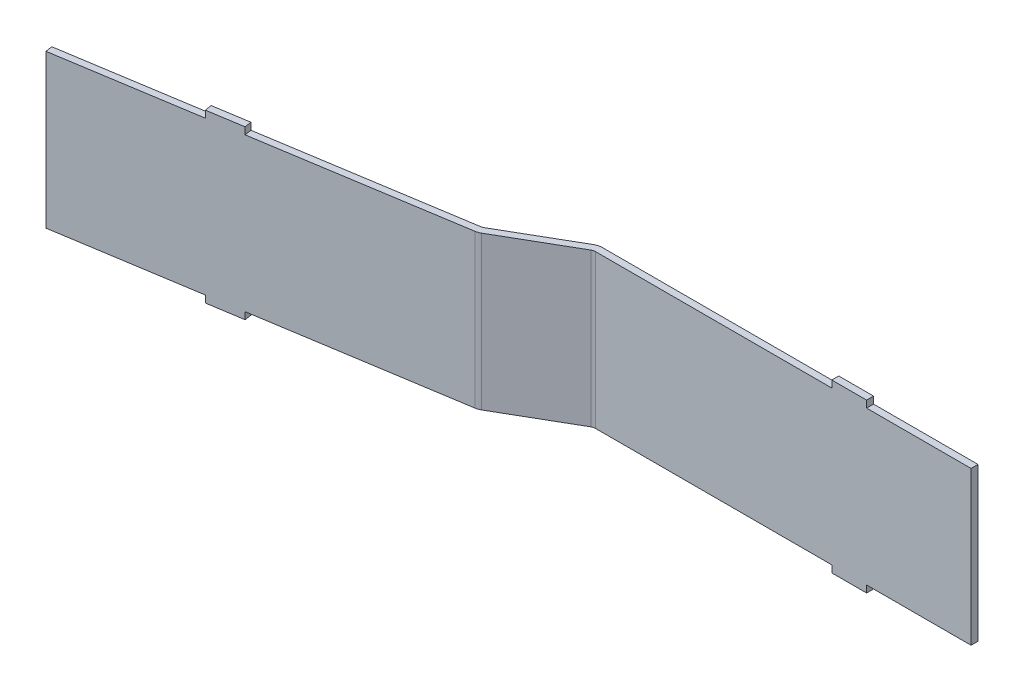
ISO-10303-21;
HEADER;
FILE_DESCRIPTION(('STEP AP214'),'2;1');
FILE_NAME('part.step','',(''),(''),'','','');
FILE_SCHEMA(('AUTOMOTIVE_DESIGN { 1 0 10303 214 1 1 1 1 }'));
ENDSEC;
DATA;
#1=APPLICATION_CONTEXT('core data for automotive mechanical design processes');
#2=APPLICATION_PROTOCOL_DEFINITION('international standard','automotive_design',2000,#1);
#3=PRODUCT_CONTEXT('',#1,'mechanical');
#4=PRODUCT('Part','Part','',(#3));
#5=PRODUCT_RELATED_PRODUCT_CATEGORY('part','',(#4));
#6=PRODUCT_DEFINITION_FORMATION('','',#4);
#7=PRODUCT_DEFINITION_CONTEXT('part definition',#1,'design');
#8=PRODUCT_DEFINITION('design','',#6,#7);
#9=PRODUCT_DEFINITION_SHAPE('','',#8);
#10=(LENGTH_UNIT() NAMED_UNIT(*) SI_UNIT(.MILLI.,.METRE.));
#11=(NAMED_UNIT(*) PLANE_ANGLE_UNIT() SI_UNIT($,.RADIAN.));
#12=(NAMED_UNIT(*) SI_UNIT($,.STERADIAN.) SOLID_ANGLE_UNIT());
#13=UNCERTAINTY_MEASURE_WITH_UNIT(LENGTH_MEASURE(1.E-05),#10,'distance_accuracy_value','');
#14=(GEOMETRIC_REPRESENTATION_CONTEXT(3) GLOBAL_UNCERTAINTY_ASSIGNED_CONTEXT((#13)) GLOBAL_UNIT_ASSIGNED_CONTEXT((#10,
#11,#12)) REPRESENTATION_CONTEXT('',''));
#15=CARTESIAN_POINT('',(0.,0.,0.));
#16=DIRECTION('',(0.,0.,1.));
#17=DIRECTION('',(1.,0.,0.));
#18=AXIS2_PLACEMENT_3D('',#15,#16,#17);
#19=CARTESIAN_POINT('',(-20.79029894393,44.,12.15667412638));
#20=DIRECTION('',(0.156434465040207,0.,0.987688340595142));
#21=DIRECTION('',(0.987688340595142,0.,-0.156434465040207));
#22=AXIS2_PLACEMENT_3D('',#19,#20,#21);
#23=PLANE('',#22);
#24=DIRECTION('',(-0.987688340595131,0.,0.156434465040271));
#25=VECTOR('',#24,1.);
#26=CARTESIAN_POINT('',(-88.4469502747,44.,22.87243498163));
#27=LINE('',#26,#25);
#28=CARTESIAN_POINT('',(-88.4469502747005,44.,22.8724349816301));
#29=VERTEX_POINT('',#28);
#30=CARTESIAN_POINT('',(-127.954483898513,44.,29.1298135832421));
#31=VERTEX_POINT('',#30);
#32=EDGE_CURVE('E258',#29,#31,#27,.T.);
#33=ORIENTED_EDGE('',*,*,#32,.F.);
#34=DIRECTION('',(0.,1.,0.));
#35=VECTOR('',#34,1.);
#36=CARTESIAN_POINT('',(-88.4469502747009,45.,22.8724349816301));
#37=LINE('',#36,#35);
#38=CARTESIAN_POINT('',(-88.4469502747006,46.,22.8724349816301));
#39=VERTEX_POINT('',#38);
#40=EDGE_CURVE('E262',#39,#29,#37,.F.);
#41=ORIENTED_EDGE('',*,*,#40,.F.);
#42=DIRECTION('',(-0.98768834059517,0.,0.156434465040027));
#43=VECTOR('',#42,1.);
#44=CARTESIAN_POINT('',(-78.57006686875,46.,21.30809033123));
#45=LINE('',#44,#43);
#46=CARTESIAN_POINT('',(-78.5700668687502,46.,21.3080903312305));
#47=VERTEX_POINT('',#46);
#48=EDGE_CURVE('E276',#47,#39,#45,.T.);
#49=ORIENTED_EDGE('',*,*,#48,.F.);
#50=DIRECTION('',(0.,1.,0.));
#51=VECTOR('',#50,1.);
#52=CARTESIAN_POINT('',(-78.5700668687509,45.,21.3080903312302));
#53=LINE('',#52,#51);
#54=CARTESIAN_POINT('',(-78.5700668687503,44.,21.3080903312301));
#55=VERTEX_POINT('',#54);
#56=EDGE_CURVE('E243',#55,#47,#53,.T.);
#57=ORIENTED_EDGE('',*,*,#56,.F.);
#58=DIRECTION('',(-0.987688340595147,0.,0.156434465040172));
#59=VECTOR('',#58,1.);
#60=CARTESIAN_POINT('',(-21.52252779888,44.,12.27264778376));
#61=LINE('',#60,#59);
#62=CARTESIAN_POINT('',(-21.5225277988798,44.,12.2726477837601));
#63=VERTEX_POINT('',#62);
#64=EDGE_CURVE('E205',#63,#55,#61,.T.);
#65=ORIENTED_EDGE('',*,*,#64,.F.);
#66=DIRECTION('',(0.,1.,0.));
#67=VECTOR('',#66,1.);
#68=CARTESIAN_POINT('',(-21.5225277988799,0.,12.2726477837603));
#69=LINE('',#68,#67);
#70=CARTESIAN_POINT('',(-21.5225277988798,0.,12.2726477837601));
#71=VERTEX_POINT('',#70);
#72=EDGE_CURVE('E199',#63,#71,#69,.F.);
#73=ORIENTED_EDGE('',*,*,#72,.T.);
#74=DIRECTION('',(0.987688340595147,0.,-0.156434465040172));
#75=VECTOR('',#74,1.);
#76=CARTESIAN_POINT('',(-78.57006686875,0.,21.30809033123));
#77=LINE('',#76,#75);
#78=CARTESIAN_POINT('',(-78.5700668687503,0.,21.3080903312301));
#79=VERTEX_POINT('',#78);
#80=EDGE_CURVE('E202',#79,#71,#77,.T.);
#81=ORIENTED_EDGE('',*,*,#80,.F.);
#82=DIRECTION('',(0.,1.,0.));
#83=VECTOR('',#82,1.);
#84=CARTESIAN_POINT('',(-78.5700668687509,-1.,21.3080903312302));
#85=LINE('',#84,#83);
#86=CARTESIAN_POINT('',(-78.5700668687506,-2.,21.3080903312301));
#87=VERTEX_POINT('',#86);
#88=EDGE_CURVE('E246',#87,#79,#85,.T.);
#89=ORIENTED_EDGE('',*,*,#88,.F.);
#90=DIRECTION('',(0.98768834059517,0.,-0.156434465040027));
#91=VECTOR('',#90,1.);
#92=CARTESIAN_POINT('',(-88.4469502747,-2.,22.87243498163));
#93=LINE('',#92,#91);
#94=CARTESIAN_POINT('',(-88.4469502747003,-2.,22.8724349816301));
#95=VERTEX_POINT('',#94);
#96=EDGE_CURVE('E293',#95,#87,#93,.T.);
#97=ORIENTED_EDGE('',*,*,#96,.F.);
#98=DIRECTION('',(0.,1.,0.));
#99=VECTOR('',#98,1.);
#100=CARTESIAN_POINT('',(-88.4469502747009,-1.,22.8724349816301));
#101=LINE('',#100,#99);
#102=CARTESIAN_POINT('',(-88.4469502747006,0.,22.8724349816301));
#103=VERTEX_POINT('',#102);
#104=EDGE_CURVE('E298',#103,#95,#101,.F.);
#105=ORIENTED_EDGE('',*,*,#104,.F.);
#106=DIRECTION('',(0.987688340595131,0.,-0.156434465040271));
#107=VECTOR('',#106,1.);
#108=CARTESIAN_POINT('',(-127.9544838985,0.,29.12981358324));
#109=LINE('',#108,#107);
#110=CARTESIAN_POINT('',(-127.954483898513,0.,29.1298135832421));
#111=VERTEX_POINT('',#110);
#112=EDGE_CURVE('E303',#111,#103,#109,.T.);
#113=ORIENTED_EDGE('',*,*,#112,.F.);
#114=DIRECTION('',(0.,1.,0.));
#115=VECTOR('',#114,1.);
#116=CARTESIAN_POINT('',(-127.95448389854,22.,29.1298135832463));
#117=LINE('',#116,#115);
#118=EDGE_CURVE('E253',#31,#111,#117,.F.);
#119=ORIENTED_EDGE('',*,*,#118,.F.);
#120=EDGE_LOOP('',(#33,#41,#49,#57,#65,#73,#81,#89,#97,#105,#113,#119));
#121=FACE_BOUND('',#120,.T.);
#122=ADVANCED_FACE('F17',(#121),#23,.F.);
#123=CARTESIAN_POINT('',(-127.7980494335,22.,30.11750192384));
#124=DIRECTION('',(-0.987688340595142,0.,0.156434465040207));
#125=DIRECTION('',(0.156434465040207,0.,0.987688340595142));
#126=AXIS2_PLACEMENT_3D('',#123,#124,#125);
#127=PLANE('',#126);
#128=DIRECTION('',(-0.156434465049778,0.,-0.987688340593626));
#129=VECTOR('',#128,1.);
#130=CARTESIAN_POINT('',(-127.6416149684,0.,31.10519026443));
#131=LINE('',#130,#129);
#132=CARTESIAN_POINT('',(-127.6416149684,0.,31.1051902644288));
#133=VERTEX_POINT('',#132);
#134=EDGE_CURVE('E255',#133,#111,#131,.T.);
#135=ORIENTED_EDGE('',*,*,#134,.F.);
#136=DIRECTION('',(0.,1.,0.));
#137=VECTOR('',#136,1.);
#138=CARTESIAN_POINT('',(-127.6416149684,44.,31.1051902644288));
#139=LINE('',#138,#137);
#140=CARTESIAN_POINT('',(-127.6416149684,44.,31.1051902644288));
#141=VERTEX_POINT('',#140);
#142=EDGE_CURVE('E209',#141,#133,#139,.F.);
#143=ORIENTED_EDGE('',*,*,#142,.F.);
#144=DIRECTION('',(0.156434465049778,0.,0.987688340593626));
#145=VECTOR('',#144,1.);
#146=CARTESIAN_POINT('',(-127.9544838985,44.,29.12981358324));
#147=LINE('',#146,#145);
#148=EDGE_CURVE('E261',#31,#141,#147,.T.);
#149=ORIENTED_EDGE('',*,*,#148,.F.);
#150=ORIENTED_EDGE('',*,*,#118,.T.);
#151=EDGE_LOOP('',(#135,#143,#149,#150));
#152=FACE_BOUND('',#151,.T.);
#153=ADVANCED_FACE('F409',(#152),#127,.T.);
#154=CARTESIAN_POINT('',(-74.58207138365,0.,21.6889190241));
#155=DIRECTION('',(0.,-1.,0.));
#156=DIRECTION('',(0.,0.,-1.));
#157=AXIS2_PLACEMENT_3D('',#154,#155,#156);
#158=PLANE('',#157);
#159=ORIENTED_EDGE('',*,*,#112,.T.);
#160=DIRECTION('',(0.156434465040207,0.,0.987688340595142));
#161=VECTOR('',#160,1.);
#162=CARTESIAN_POINT('',(-88.29051580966,0.,23.86012332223));
#163=LINE('',#162,#161);
#164=CARTESIAN_POINT('',(-88.1340813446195,0.,24.8478116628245));
#165=VERTEX_POINT('',#164);
#166=EDGE_CURVE('E300',#165,#103,#163,.F.);
#167=ORIENTED_EDGE('',*,*,#166,.F.);
#168=DIRECTION('',(0.987688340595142,0.,-0.156434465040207));
#169=VECTOR('',#168,1.);
#170=CARTESIAN_POINT('',(-20.47743001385,0.,14.13205080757));
#171=LINE('',#170,#169);
#172=EDGE_CURVE('E387',#133,#165,#171,.T.);
#173=ORIENTED_EDGE('',*,*,#172,.F.);
#174=ORIENTED_EDGE('',*,*,#134,.T.);
#175=EDGE_LOOP('',(#159,#167,#173,#174));
#176=FACE_BOUND('',#175,.T.);
#177=ADVANCED_FACE('F415',(#176),#158,.T.);
#178=CARTESIAN_POINT('',(-88.29051580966,-1.,23.86012332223));
#179=DIRECTION('',(-0.987688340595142,0.,0.156434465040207));
#180=DIRECTION('',(0.156434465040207,0.,0.987688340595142));
#181=AXIS2_PLACEMENT_3D('',#178,#179,#180);
#182=PLANE('',#181);
#183=ORIENTED_EDGE('',*,*,#166,.T.);
#184=ORIENTED_EDGE('',*,*,#104,.T.);
#185=DIRECTION('',(-0.15643446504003,0.,-0.98768834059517));
#186=VECTOR('',#185,1.);
#187=CARTESIAN_POINT('',(-88.13408134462,-2.,24.84781166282));
#188=LINE('',#187,#186);
#189=CARTESIAN_POINT('',(-88.1340813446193,-2.,24.8478116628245));
#190=VERTEX_POINT('',#189);
#191=EDGE_CURVE('E295',#190,#95,#188,.T.);
#192=ORIENTED_EDGE('',*,*,#191,.F.);
#193=DIRECTION('',(0.,1.,0.));
#194=VECTOR('',#193,1.);
#195=CARTESIAN_POINT('',(-88.1340813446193,44.,24.8478116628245));
#196=LINE('',#195,#194);
#197=EDGE_CURVE('E378',#165,#190,#196,.F.);
#198=ORIENTED_EDGE('',*,*,#197,.F.);
#199=EDGE_LOOP('',(#183,#184,#192,#198));
#200=FACE_BOUND('',#199,.T.);
#201=ADVANCED_FACE('F418',(#200),#182,.T.);
#202=CARTESIAN_POINT('',(-83.35207410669,-2.,23.07795099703));
#203=DIRECTION('',(0.,-1.,0.));
#204=DIRECTION('',(0.,0.,-1.));
#205=AXIS2_PLACEMENT_3D('',#202,#203,#204);
#206=PLANE('',#205);
#207=ORIENTED_EDGE('',*,*,#191,.T.);
#208=ORIENTED_EDGE('',*,*,#96,.T.);
#209=DIRECTION('',(-0.156434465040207,0.,-0.987688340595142));
#210=VECTOR('',#209,1.);
#211=CARTESIAN_POINT('',(-78.41363240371,-2.,22.29577867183));
#212=LINE('',#211,#210);
#213=CARTESIAN_POINT('',(-78.2571979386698,-2.,23.2834670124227));
#214=VERTEX_POINT('',#213);
#215=EDGE_CURVE('E250',#214,#87,#212,.T.);
#216=ORIENTED_EDGE('',*,*,#215,.F.);
#217=DIRECTION('',(0.987688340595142,0.,-0.156434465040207));
#218=VECTOR('',#217,1.);
#219=CARTESIAN_POINT('',(-20.47743001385,-2.,14.13205080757));
#220=LINE('',#219,#218);
#221=EDGE_CURVE('E369',#190,#214,#220,.T.);
#222=ORIENTED_EDGE('',*,*,#221,.F.);
#223=EDGE_LOOP('',(#207,#208,#216,#222));
#224=FACE_BOUND('',#223,.T.);
#225=ADVANCED_FACE('F422',(#224),#206,.T.);
#226=CARTESIAN_POINT('',(-78.41363240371,-1.,22.29577867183));
#227=DIRECTION('',(0.987688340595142,0.,-0.156434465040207));
#228=DIRECTION('',(-0.156434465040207,0.,-0.987688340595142));
#229=AXIS2_PLACEMENT_3D('',#226,#227,#228);
#230=PLANE('',#229);
#231=ORIENTED_EDGE('',*,*,#215,.T.);
#232=ORIENTED_EDGE('',*,*,#88,.T.);
#233=DIRECTION('',(-0.156434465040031,0.,-0.98768834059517));
#234=VECTOR('',#233,1.);
#235=CARTESIAN_POINT('',(-78.25719793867,0.,23.28346701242));
#236=LINE('',#235,#234);
#237=CARTESIAN_POINT('',(-78.2571979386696,0.,23.2834670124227));
#238=VERTEX_POINT('',#237);
#239=EDGE_CURVE('E219',#238,#79,#236,.T.);
#240=ORIENTED_EDGE('',*,*,#239,.F.);
#241=DIRECTION('',(0.,1.,0.));
#242=VECTOR('',#241,1.);
#243=CARTESIAN_POINT('',(-78.2571979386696,44.,23.2834670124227));
#244=LINE('',#243,#242);
#245=EDGE_CURVE('E349',#214,#238,#244,.T.);
#246=ORIENTED_EDGE('',*,*,#245,.F.);
#247=EDGE_LOOP('',(#231,#232,#240,#246));
#248=FACE_BOUND('',#247,.T.);
#249=ADVANCED_FACE('F426',(#248),#230,.T.);
#250=CARTESIAN_POINT('',(-78.41363240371,45.,22.29577867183));
#251=DIRECTION('',(0.987688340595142,0.,-0.156434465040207));
#252=DIRECTION('',(-0.156434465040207,0.,-0.987688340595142));
#253=AXIS2_PLACEMENT_3D('',#250,#251,#252);
#254=PLANE('',#253);
#255=DIRECTION('',(0.156434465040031,0.,0.98768834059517));
#256=VECTOR('',#255,1.);
#257=CARTESIAN_POINT('',(-78.57006686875,44.,21.30809033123));
#258=LINE('',#257,#256);
#259=CARTESIAN_POINT('',(-78.2571979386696,44.,23.2834670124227));
#260=VERTEX_POINT('',#259);
#261=EDGE_CURVE('E210',#55,#260,#258,.T.);
#262=ORIENTED_EDGE('',*,*,#261,.F.);
#263=ORIENTED_EDGE('',*,*,#56,.T.);
#264=DIRECTION('',(-0.156434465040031,0.,-0.98768834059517));
#265=VECTOR('',#264,1.);
#266=CARTESIAN_POINT('',(-78.25719793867,46.,23.28346701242));
#267=LINE('',#266,#265);
#268=CARTESIAN_POINT('',(-78.2571979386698,46.,23.283467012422));
#269=VERTEX_POINT('',#268);
#270=EDGE_CURVE('E245',#269,#47,#267,.T.);
#271=ORIENTED_EDGE('',*,*,#270,.F.);
#272=DIRECTION('',(0.,1.,0.));
#273=VECTOR('',#272,1.);
#274=CARTESIAN_POINT('',(-78.2571979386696,44.,23.2834670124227));
#275=LINE('',#274,#273);
#276=EDGE_CURVE('E286',#260,#269,#275,.T.);
#277=ORIENTED_EDGE('',*,*,#276,.F.);
#278=EDGE_LOOP('',(#262,#263,#271,#277));
#279=FACE_BOUND('',#278,.T.);
#280=ADVANCED_FACE('F782',(#279),#254,.T.);
#281=CARTESIAN_POINT('',(-83.35207410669,46.,23.07795099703));
#282=DIRECTION('',(0.,1.,0.));
#283=DIRECTION('',(0.,0.,1.));
#284=AXIS2_PLACEMENT_3D('',#281,#282,#283);
#285=PLANE('',#284);
#286=ORIENTED_EDGE('',*,*,#270,.T.);
#287=ORIENTED_EDGE('',*,*,#48,.T.);
#288=DIRECTION('',(0.156434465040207,0.,0.987688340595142));
#289=VECTOR('',#288,1.);
#290=CARTESIAN_POINT('',(-88.29051580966,46.,23.86012332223));
#291=LINE('',#290,#289);
#292=CARTESIAN_POINT('',(-88.1340813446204,46.,24.8478116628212));
#293=VERTEX_POINT('',#292);
#294=EDGE_CURVE('E267',#293,#39,#291,.F.);
#295=ORIENTED_EDGE('',*,*,#294,.F.);
#296=DIRECTION('',(0.987688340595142,0.,-0.156434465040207));
#297=VECTOR('',#296,1.);
#298=CARTESIAN_POINT('',(-20.47743001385,46.,14.13205080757));
#299=LINE('',#298,#297);
#300=EDGE_CURVE('E235',#269,#293,#299,.F.);
#301=ORIENTED_EDGE('',*,*,#300,.F.);
#302=EDGE_LOOP('',(#286,#287,#295,#301));
#303=FACE_BOUND('',#302,.T.);
#304=ADVANCED_FACE('F774',(#303),#285,.T.);
#305=CARTESIAN_POINT('',(-88.29051580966,45.,23.86012332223));
#306=DIRECTION('',(-0.987688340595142,0.,0.156434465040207));
#307=DIRECTION('',(0.156434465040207,0.,0.987688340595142));
#308=AXIS2_PLACEMENT_3D('',#305,#306,#307);
#309=PLANE('',#308);
#310=ORIENTED_EDGE('',*,*,#294,.T.);
#311=ORIENTED_EDGE('',*,*,#40,.T.);
#312=DIRECTION('',(-0.15643446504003,0.,-0.98768834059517));
#313=VECTOR('',#312,1.);
#314=CARTESIAN_POINT('',(-88.13408134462,44.,24.84781166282));
#315=LINE('',#314,#313);
#316=CARTESIAN_POINT('',(-88.1340813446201,44.,24.8478116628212));
#317=VERTEX_POINT('',#316);
#318=EDGE_CURVE('E220',#317,#29,#315,.T.);
#319=ORIENTED_EDGE('',*,*,#318,.F.);
#320=DIRECTION('',(0.,1.,0.));
#321=VECTOR('',#320,1.);
#322=CARTESIAN_POINT('',(-88.1340813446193,44.,24.8478116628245));
#323=LINE('',#322,#321);
#324=EDGE_CURVE('E229',#293,#317,#323,.F.);
#325=ORIENTED_EDGE('',*,*,#324,.F.);
#326=EDGE_LOOP('',(#310,#311,#319,#325));
#327=FACE_BOUND('',#326,.T.);
#328=ADVANCED_FACE('F767',(#327),#309,.T.);
#329=CARTESIAN_POINT('',(-74.58207138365,44.,21.6889190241));
#330=DIRECTION('',(0.,1.,0.));
#331=DIRECTION('',(0.,0.,1.));
#332=AXIS2_PLACEMENT_3D('',#329,#330,#331);
#333=PLANE('',#332);
#334=DIRECTION('',(0.987688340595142,0.,-0.156434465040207));
#335=VECTOR('',#334,1.);
#336=CARTESIAN_POINT('',(-20.47743001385,44.,14.13205080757));
#337=LINE('',#336,#335);
#338=EDGE_CURVE('E227',#317,#141,#337,.F.);
#339=ORIENTED_EDGE('',*,*,#338,.F.);
#340=ORIENTED_EDGE('',*,*,#318,.T.);
#341=ORIENTED_EDGE('',*,*,#32,.T.);
#342=ORIENTED_EDGE('',*,*,#148,.T.);
#343=EDGE_LOOP('',(#339,#340,#341,#342));
#344=FACE_BOUND('',#343,.T.);
#345=ADVANCED_FACE('F407',(#344),#333,.T.);
#346=CARTESIAN_POINT('',(-21.83539672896,0.,10.29727110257));
#347=DIRECTION('',(0.,1.,0.));
#348=DIRECTION('',(0.,0.,1.));
#349=AXIS2_PLACEMENT_3D('',#346,#347,#348);
#350=CYLINDRICAL_SURFACE('',#349,2.);
#351=DIRECTION('',(0.,1.,0.));
#352=VECTOR('',#351,1.);
#353=CARTESIAN_POINT('',(-20.8353967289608,0.,12.0293219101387));
#354=LINE('',#353,#352);
#355=CARTESIAN_POINT('',(-20.8353967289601,0.,12.0293219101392));
#356=VERTEX_POINT('',#355);
#357=CARTESIAN_POINT('',(-20.8353967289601,44.,12.0293219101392));
#358=VERTEX_POINT('',#357);
#359=EDGE_CURVE('E225',#356,#358,#354,.T.);
#360=ORIENTED_EDGE('',*,*,#359,.F.);
#361=CARTESIAN_POINT('',(-21.83539672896,0.,10.29727110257));
#362=DIRECTION('',(0.,1.,0.));
#363=DIRECTION('',(0.,0.,1.));
#364=AXIS2_PLACEMENT_3D('',#361,#362,#363);
#365=CIRCLE('',#364,2.);
#366=EDGE_CURVE('E20',#71,#356,#365,.T.);
#367=ORIENTED_EDGE('',*,*,#366,.F.);
#368=ORIENTED_EDGE('',*,*,#72,.F.);
#369=CARTESIAN_POINT('',(-21.83539672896,44.,10.29727110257));
#370=DIRECTION('',(0.,1.,0.));
#371=DIRECTION('',(0.,0.,1.));
#372=AXIS2_PLACEMENT_3D('',#369,#370,#371);
#373=CIRCLE('',#372,2.);
#374=EDGE_CURVE('E226',#63,#358,#373,.T.);
#375=ORIENTED_EDGE('',*,*,#374,.T.);
#376=EDGE_LOOP('',(#360,#367,#368,#375));
#377=FACE_BOUND('',#376,.T.);
#378=ADVANCED_FACE('F223',(#377),#350,.F.);
#379=CARTESIAN_POINT('',(-20.47743001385,44.,14.13205080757));
#380=DIRECTION('',(0.156434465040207,0.,0.987688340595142));
#381=DIRECTION('',(0.987688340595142,0.,-0.156434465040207));
#382=AXIS2_PLACEMENT_3D('',#379,#380,#381);
#383=PLANE('',#382);
#384=ORIENTED_EDGE('',*,*,#324,.T.);
#385=ORIENTED_EDGE('',*,*,#338,.T.);
#386=ORIENTED_EDGE('',*,*,#142,.T.);
#387=ORIENTED_EDGE('',*,*,#172,.T.);
#388=ORIENTED_EDGE('',*,*,#197,.T.);
#389=ORIENTED_EDGE('',*,*,#221,.T.);
#390=ORIENTED_EDGE('',*,*,#245,.T.);
#391=DIRECTION('',(0.987688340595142,0.,-0.156434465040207));
#392=VECTOR('',#391,1.);
#393=CARTESIAN_POINT('',(-20.47743001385,0.,14.13205080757));
#394=LINE('',#393,#392);
#395=CARTESIAN_POINT('',(-21.2096588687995,0.,14.2480244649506));
#396=VERTEX_POINT('',#395);
#397=EDGE_CURVE('E344',#238,#396,#394,.T.);
#398=ORIENTED_EDGE('',*,*,#397,.T.);
#399=DIRECTION('',(0.,1.,0.));
#400=VECTOR('',#399,1.);
#401=CARTESIAN_POINT('',(-21.2096588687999,0.,14.2480244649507));
#402=LINE('',#401,#400);
#403=CARTESIAN_POINT('',(-21.2096588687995,44.,14.2480244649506));
#404=VERTEX_POINT('',#403);
#405=EDGE_CURVE('E325',#404,#396,#402,.F.);
#406=ORIENTED_EDGE('',*,*,#405,.F.);
#407=DIRECTION('',(0.987688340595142,0.,-0.156434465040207));
#408=VECTOR('',#407,1.);
#409=CARTESIAN_POINT('',(-20.47743001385,44.,14.13205080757));
#410=LINE('',#409,#408);
#411=EDGE_CURVE('E341',#404,#260,#410,.F.);
#412=ORIENTED_EDGE('',*,*,#411,.T.);
#413=ORIENTED_EDGE('',*,*,#276,.T.);
#414=ORIENTED_EDGE('',*,*,#300,.T.);
#415=EDGE_LOOP('',(#384,#385,#386,#387,#388,#389,#390,#398,#406,#412,#413,#414));
#416=FACE_BOUND('',#415,.T.);
#417=ADVANCED_FACE('F412',(#416),#383,.T.);
#418=CARTESIAN_POINT('',(0.,0.,0.));
#419=DIRECTION('',(-0.500000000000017,0.,-0.866025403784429));
#420=DIRECTION('',(-0.866025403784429,0.,0.500000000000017));
#421=AXIS2_PLACEMENT_3D('',#418,#419,#420);
#422=PLANE('',#421);
#423=DIRECTION('',(0.,-1.,0.));
#424=VECTOR('',#423,1.);
#425=CARTESIAN_POINT('',(-0.928203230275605,44.,0.535898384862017));
#426=LINE('',#425,#424);
#427=CARTESIAN_POINT('',(-0.928203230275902,0.,0.535898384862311));
#428=VERTEX_POINT('',#427);
#429=CARTESIAN_POINT('',(-0.928203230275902,44.,0.53589838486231));
#430=VERTEX_POINT('',#429);
#431=EDGE_CURVE('E432',#428,#430,#426,.F.);
#432=ORIENTED_EDGE('',*,*,#431,.F.);
#433=DIRECTION('',(0.866025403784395,0.,-0.500000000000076));
#434=VECTOR('',#433,1.);
#435=CARTESIAN_POINT('',(-20.83539672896,0.,12.02932191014));
#436=LINE('',#435,#434);
#437=EDGE_CURVE('E340',#356,#428,#436,.T.);
#438=ORIENTED_EDGE('',*,*,#437,.F.);
#439=ORIENTED_EDGE('',*,*,#359,.T.);
#440=DIRECTION('',(-0.866025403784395,0.,0.500000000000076));
#441=VECTOR('',#440,1.);
#442=CARTESIAN_POINT('',(-0.928203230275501,44.,0.5358983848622));
#443=LINE('',#442,#441);
#444=EDGE_CURVE('E435',#430,#358,#443,.T.);
#445=ORIENTED_EDGE('',*,*,#444,.F.);
#446=EDGE_LOOP('',(#432,#438,#439,#445));
#447=FACE_BOUND('',#446,.T.);
#448=ADVANCED_FACE('F443',(#447),#422,.T.);
#449=CARTESIAN_POINT('',(-21.83539672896,0.,10.29727110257));
#450=DIRECTION('',(0.,1.,0.));
#451=DIRECTION('',(0.,0.,1.));
#452=AXIS2_PLACEMENT_3D('',#449,#450,#451);
#453=CYLINDRICAL_SURFACE('',#452,4.);
#454=CARTESIAN_POINT('',(-21.83539672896,44.,10.29727110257));
#455=DIRECTION('',(0.,1.,0.));
#456=DIRECTION('',(0.,0.,1.));
#457=AXIS2_PLACEMENT_3D('',#454,#455,#456);
#458=CIRCLE('',#457,4.);
#459=CARTESIAN_POINT('',(-19.8353967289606,44.,13.7613727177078));
#460=VERTEX_POINT('',#459);
#461=EDGE_CURVE('E322',#460,#404,#458,.F.);
#462=ORIENTED_EDGE('',*,*,#461,.T.);
#463=ORIENTED_EDGE('',*,*,#405,.T.);
#464=CARTESIAN_POINT('',(-21.83539672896,0.,10.29727110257));
#465=DIRECTION('',(0.,1.,0.));
#466=DIRECTION('',(0.,0.,1.));
#467=AXIS2_PLACEMENT_3D('',#464,#465,#466);
#468=CIRCLE('',#467,4.);
#469=CARTESIAN_POINT('',(-19.8353967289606,0.,13.7613727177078));
#470=VERTEX_POINT('',#469);
#471=EDGE_CURVE('E326',#396,#470,#468,.T.);
#472=ORIENTED_EDGE('',*,*,#471,.T.);
#473=DIRECTION('',(0.,1.,0.));
#474=VECTOR('',#473,1.);
#475=CARTESIAN_POINT('',(-19.8353967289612,0.,13.7613727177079));
#476=LINE('',#475,#474);
#477=EDGE_CURVE('E337',#470,#460,#476,.T.);
#478=ORIENTED_EDGE('',*,*,#477,.T.);
#479=EDGE_LOOP('',(#462,#463,#472,#478));
#480=FACE_BOUND('',#479,.T.);
#481=ADVANCED_FACE('F736',(#480),#453,.T.);
#482=CARTESIAN_POINT('',(1.071796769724,44.,4.));
#483=DIRECTION('',(0.,-1.,0.));
#484=DIRECTION('',(0.,0.,-1.));
#485=AXIS2_PLACEMENT_3D('',#482,#483,#484);
#486=CYLINDRICAL_SURFACE('',#485,4.);
#487=CARTESIAN_POINT('',(1.071796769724,0.,4.));
#488=DIRECTION('',(0.,-1.,0.));
#489=DIRECTION('',(0.,0.,-1.));
#490=AXIS2_PLACEMENT_3D('',#487,#488,#489);
#491=CIRCLE('',#490,4.);
#492=CARTESIAN_POINT('',(1.071796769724,0.,0.));
#493=VERTEX_POINT('',#492);
#494=EDGE_CURVE('E318',#493,#428,#491,.F.);
#495=ORIENTED_EDGE('',*,*,#494,.T.);
#496=ORIENTED_EDGE('',*,*,#431,.T.);
#497=CARTESIAN_POINT('',(1.071796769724,44.,4.));
#498=DIRECTION('',(0.,-1.,0.));
#499=DIRECTION('',(0.,0.,-1.));
#500=AXIS2_PLACEMENT_3D('',#497,#498,#499);
#501=CIRCLE('',#500,4.);
#502=CARTESIAN_POINT('',(1.071796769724,44.,0.));
#503=VERTEX_POINT('',#502);
#504=EDGE_CURVE('E314',#503,#430,#501,.F.);
#505=ORIENTED_EDGE('',*,*,#504,.F.);
#506=DIRECTION('',(0.,1.,0.));
#507=VECTOR('',#506,1.);
#508=CARTESIAN_POINT('',(1.071796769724,0.,0.));
#509=LINE('',#508,#507);
#510=EDGE_CURVE('E317',#503,#493,#509,.F.);
#511=ORIENTED_EDGE('',*,*,#510,.T.);
#512=EDGE_LOOP('',(#495,#496,#505,#511));
#513=FACE_BOUND('',#512,.T.);
#514=ADVANCED_FACE('F445',(#513),#486,.T.);
#515=CARTESIAN_POINT('',(1.,0.,1.732050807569));
#516=DIRECTION('',(-0.500000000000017,0.,-0.866025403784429));
#517=DIRECTION('',(-0.866025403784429,0.,0.500000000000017));
#518=AXIS2_PLACEMENT_3D('',#515,#516,#517);
#519=PLANE('',#518);
#520=DIRECTION('',(-0.866025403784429,0.,0.500000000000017));
#521=VECTOR('',#520,1.);
#522=CARTESIAN_POINT('',(1.,44.,1.732050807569));
#523=LINE('',#522,#521);
#524=CARTESIAN_POINT('',(0.0717967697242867,44.,2.26794919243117));
#525=VERTEX_POINT('',#524);
#526=EDGE_CURVE('E321',#460,#525,#523,.F.);
#527=ORIENTED_EDGE('',*,*,#526,.F.);
#528=ORIENTED_EDGE('',*,*,#477,.F.);
#529=DIRECTION('',(-0.866025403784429,0.,0.500000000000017));
#530=VECTOR('',#529,1.);
#531=CARTESIAN_POINT('',(1.,0.,1.732050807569));
#532=LINE('',#531,#530);
#533=CARTESIAN_POINT('',(0.0717967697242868,0.,2.26794919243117));
#534=VERTEX_POINT('',#533);
#535=EDGE_CURVE('E427',#534,#470,#532,.T.);
#536=ORIENTED_EDGE('',*,*,#535,.F.);
#537=DIRECTION('',(0.,-1.,0.));
#538=VECTOR('',#537,1.);
#539=CARTESIAN_POINT('',(0.0717967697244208,44.,2.26794919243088));
#540=LINE('',#539,#538);
#541=EDGE_CURVE('E313',#534,#525,#540,.F.);
#542=ORIENTED_EDGE('',*,*,#541,.T.);
#543=EDGE_LOOP('',(#527,#528,#536,#542));
#544=FACE_BOUND('',#543,.T.);
#545=ADVANCED_FACE('F723',(#544),#519,.F.);
#546=CARTESIAN_POINT('',(0.,0.,0.));
#547=DIRECTION('',(0.,0.,1.));
#548=DIRECTION('',(1.,0.,0.));
#549=AXIS2_PLACEMENT_3D('',#546,#547,#548);
#550=PLANE('',#549);
#551=DIRECTION('',(1.,0.,0.));
#552=VECTOR('',#551,1.);
#553=CARTESIAN_POINT('',(54.5,44.,0.));
#554=LINE('',#553,#552);
#555=CARTESIAN_POINT('',(69.,44.,0.));
#556=VERTEX_POINT('',#555);
#557=EDGE_CURVE('E454',#556,#503,#554,.F.);
#558=ORIENTED_EDGE('',*,*,#557,.F.);
#559=DIRECTION('',(0.,1.,0.));
#560=VECTOR('',#559,1.);
#561=CARTESIAN_POINT('',(69.,45.,0.));
#562=LINE('',#561,#560);
#563=CARTESIAN_POINT('',(69.,46.,0.));
#564=VERTEX_POINT('',#563);
#565=EDGE_CURVE('E452',#564,#556,#562,.F.);
#566=ORIENTED_EDGE('',*,*,#565,.F.);
#567=DIRECTION('',(1.,0.,0.));
#568=VECTOR('',#567,1.);
#569=CARTESIAN_POINT('',(74.,46.,0.));
#570=LINE('',#569,#568);
#571=CARTESIAN_POINT('',(79.,46.,0.));
#572=VERTEX_POINT('',#571);
#573=EDGE_CURVE('E464',#572,#564,#570,.F.);
#574=ORIENTED_EDGE('',*,*,#573,.F.);
#575=DIRECTION('',(0.,1.,0.));
#576=VECTOR('',#575,1.);
#577=CARTESIAN_POINT('',(79.,45.,0.));
#578=LINE('',#577,#576);
#579=CARTESIAN_POINT('',(79.,44.,0.));
#580=VERTEX_POINT('',#579);
#581=EDGE_CURVE('E483',#580,#572,#578,.T.);
#582=ORIENTED_EDGE('',*,*,#581,.F.);
#583=DIRECTION('',(1.,0.,0.));
#584=VECTOR('',#583,1.);
#585=CARTESIAN_POINT('',(54.5,44.,0.));
#586=LINE('',#585,#584);
#587=CARTESIAN_POINT('',(109.,44.,0.));
#588=VERTEX_POINT('',#587);
#589=EDGE_CURVE('E497',#588,#580,#586,.F.);
#590=ORIENTED_EDGE('',*,*,#589,.F.);
#591=DIRECTION('',(0.,1.,0.));
#592=VECTOR('',#591,1.);
#593=CARTESIAN_POINT('',(109.,22.,0.));
#594=LINE('',#593,#592);
#595=CARTESIAN_POINT('',(109.,0.,0.));
#596=VERTEX_POINT('',#595);
#597=EDGE_CURVE('E511',#596,#588,#594,.T.);
#598=ORIENTED_EDGE('',*,*,#597,.F.);
#599=DIRECTION('',(1.,0.,0.));
#600=VECTOR('',#599,1.);
#601=CARTESIAN_POINT('',(54.5,0.,0.));
#602=LINE('',#601,#600);
#603=CARTESIAN_POINT('',(79.,0.,0.));
#604=VERTEX_POINT('',#603);
#605=EDGE_CURVE('E528',#604,#596,#602,.T.);
#606=ORIENTED_EDGE('',*,*,#605,.F.);
#607=DIRECTION('',(0.,1.,0.));
#608=VECTOR('',#607,1.);
#609=CARTESIAN_POINT('',(79.,-1.,0.));
#610=LINE('',#609,#608);
#611=CARTESIAN_POINT('',(79.,-2.,0.));
#612=VERTEX_POINT('',#611);
#613=EDGE_CURVE('E530',#612,#604,#610,.T.);
#614=ORIENTED_EDGE('',*,*,#613,.F.);
#615=DIRECTION('',(1.,0.,0.));
#616=VECTOR('',#615,1.);
#617=CARTESIAN_POINT('',(74.,-2.,0.));
#618=LINE('',#617,#616);
#619=CARTESIAN_POINT('',(69.,-2.,0.));
#620=VERTEX_POINT('',#619);
#621=EDGE_CURVE('E549',#620,#612,#618,.T.);
#622=ORIENTED_EDGE('',*,*,#621,.F.);
#623=DIRECTION('',(0.,1.,0.));
#624=VECTOR('',#623,1.);
#625=CARTESIAN_POINT('',(69.,-1.,0.));
#626=LINE('',#625,#624);
#627=CARTESIAN_POINT('',(69.,0.,0.));
#628=VERTEX_POINT('',#627);
#629=EDGE_CURVE('E568',#628,#620,#626,.F.);
#630=ORIENTED_EDGE('',*,*,#629,.F.);
#631=DIRECTION('',(1.,0.,0.));
#632=VECTOR('',#631,1.);
#633=CARTESIAN_POINT('',(54.5,0.,0.));
#634=LINE('',#633,#632);
#635=EDGE_CURVE('E310',#493,#628,#634,.T.);
#636=ORIENTED_EDGE('',*,*,#635,.F.);
#637=ORIENTED_EDGE('',*,*,#510,.F.);
#638=EDGE_LOOP('',(#558,#566,#574,#582,#590,#598,#606,#614,#622,#630,#636,#637));
#639=FACE_BOUND('',#638,.T.);
#640=ADVANCED_FACE('F598',(#639),#550,.F.);
#641=CARTESIAN_POINT('',(1.071796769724,44.,4.));
#642=DIRECTION('',(0.,-1.,0.));
#643=DIRECTION('',(0.,0.,-1.));
#644=AXIS2_PLACEMENT_3D('',#641,#642,#643);
#645=CYLINDRICAL_SURFACE('',#644,2.);
#646=DIRECTION('',(0.,1.,0.));
#647=VECTOR('',#646,1.);
#648=CARTESIAN_POINT('',(1.071796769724,0.,2.));
#649=LINE('',#648,#647);
#650=CARTESIAN_POINT('',(1.071796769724,44.,2.));
#651=VERTEX_POINT('',#650);
#652=CARTESIAN_POINT('',(1.071796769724,0.,2.));
#653=VERTEX_POINT('',#652);
#654=EDGE_CURVE('E459',#651,#653,#649,.F.);
#655=ORIENTED_EDGE('',*,*,#654,.F.);
#656=CARTESIAN_POINT('',(1.071796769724,44.,4.));
#657=DIRECTION('',(0.,-1.,0.));
#658=DIRECTION('',(0.,0.,-1.));
#659=AXIS2_PLACEMENT_3D('',#656,#657,#658);
#660=CIRCLE('',#659,2.);
#661=EDGE_CURVE('E311',#525,#651,#660,.T.);
#662=ORIENTED_EDGE('',*,*,#661,.F.);
#663=ORIENTED_EDGE('',*,*,#541,.F.);
#664=CARTESIAN_POINT('',(1.071796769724,0.,4.));
#665=DIRECTION('',(0.,-1.,0.));
#666=DIRECTION('',(0.,0.,-1.));
#667=AXIS2_PLACEMENT_3D('',#664,#665,#666);
#668=CIRCLE('',#667,2.);
#669=EDGE_CURVE('E307',#653,#534,#668,.F.);
#670=ORIENTED_EDGE('',*,*,#669,.F.);
#671=EDGE_LOOP('',(#655,#662,#663,#670));
#672=FACE_BOUND('',#671,.T.);
#673=ADVANCED_FACE('F640',(#672),#645,.F.);
#674=CARTESIAN_POINT('',(54.5,0.,1.));
#675=DIRECTION('',(0.,-1.,0.));
#676=DIRECTION('',(0.,0.,-1.));
#677=AXIS2_PLACEMENT_3D('',#674,#675,#676);
#678=PLANE('',#677);
#679=ORIENTED_EDGE('',*,*,#635,.T.);
#680=DIRECTION('',(0.,0.,1.));
#681=VECTOR('',#680,1.);
#682=CARTESIAN_POINT('',(69.,0.,1.));
#683=LINE('',#682,#681);
#684=CARTESIAN_POINT('',(69.,0.,2.));
#685=VERTEX_POINT('',#684);
#686=EDGE_CURVE('E572',#685,#628,#683,.F.);
#687=ORIENTED_EDGE('',*,*,#686,.F.);
#688=DIRECTION('',(1.,0.,0.));
#689=VECTOR('',#688,1.);
#690=CARTESIAN_POINT('',(0.,0.,2.));
#691=LINE('',#690,#689);
#692=EDGE_CURVE('E577',#653,#685,#691,.T.);
#693=ORIENTED_EDGE('',*,*,#692,.F.);
#694=ORIENTED_EDGE('',*,*,#669,.T.);
#695=ORIENTED_EDGE('',*,*,#535,.T.);
#696=ORIENTED_EDGE('',*,*,#471,.F.);
#697=ORIENTED_EDGE('',*,*,#397,.F.);
#698=ORIENTED_EDGE('',*,*,#239,.T.);
#699=ORIENTED_EDGE('',*,*,#80,.T.);
#700=ORIENTED_EDGE('',*,*,#366,.T.);
#701=ORIENTED_EDGE('',*,*,#437,.T.);
#702=ORIENTED_EDGE('',*,*,#494,.F.);
#703=EDGE_LOOP('',(#679,#687,#693,#694,#695,#696,#697,#698,#699,#700,#701,#702));
#704=FACE_BOUND('',#703,.T.);
#705=ADVANCED_FACE('F215',(#704),#678,.T.);
#706=CARTESIAN_POINT('',(69.,-1.,1.));
#707=DIRECTION('',(-1.,0.,0.));
#708=DIRECTION('',(0.,0.,1.));
#709=AXIS2_PLACEMENT_3D('',#706,#707,#708);
#710=PLANE('',#709);
#711=DIRECTION('',(0.,0.,-1.));
#712=VECTOR('',#711,1.);
#713=CARTESIAN_POINT('',(69.,-2.,1.));
#714=LINE('',#713,#712);
#715=CARTESIAN_POINT('',(69.,-2.,2.));
#716=VERTEX_POINT('',#715);
#717=EDGE_CURVE('E553',#716,#620,#714,.T.);
#718=ORIENTED_EDGE('',*,*,#717,.F.);
#719=DIRECTION('',(0.,1.,0.));
#720=VECTOR('',#719,1.);
#721=CARTESIAN_POINT('',(69.,0.,2.));
#722=LINE('',#721,#720);
#723=EDGE_CURVE('E563',#685,#716,#722,.F.);
#724=ORIENTED_EDGE('',*,*,#723,.F.);
#725=ORIENTED_EDGE('',*,*,#686,.T.);
#726=ORIENTED_EDGE('',*,*,#629,.T.);
#727=EDGE_LOOP('',(#718,#724,#725,#726));
#728=FACE_BOUND('',#727,.T.);
#729=ADVANCED_FACE('F631',(#728),#710,.T.);
#730=CARTESIAN_POINT('',(74.,-2.,1.));
#731=DIRECTION('',(0.,-1.,0.));
#732=DIRECTION('',(0.,0.,-1.));
#733=AXIS2_PLACEMENT_3D('',#730,#731,#732);
#734=PLANE('',#733);
#735=DIRECTION('',(0.,0.,-1.));
#736=VECTOR('',#735,1.);
#737=CARTESIAN_POINT('',(79.,-2.,1.));
#738=LINE('',#737,#736);
#739=CARTESIAN_POINT('',(79.,-2.,2.));
#740=VERTEX_POINT('',#739);
#741=EDGE_CURVE('E540',#740,#612,#738,.T.);
#742=ORIENTED_EDGE('',*,*,#741,.F.);
#743=DIRECTION('',(1.,0.,0.));
#744=VECTOR('',#743,1.);
#745=CARTESIAN_POINT('',(0.,-2.,2.));
#746=LINE('',#745,#744);
#747=EDGE_CURVE('E558',#716,#740,#746,.T.);
#748=ORIENTED_EDGE('',*,*,#747,.F.);
#749=ORIENTED_EDGE('',*,*,#717,.T.);
#750=ORIENTED_EDGE('',*,*,#621,.T.);
#751=EDGE_LOOP('',(#742,#748,#749,#750));
#752=FACE_BOUND('',#751,.T.);
#753=ADVANCED_FACE('F628',(#752),#734,.T.);
#754=CARTESIAN_POINT('',(79.,-1.,1.));
#755=DIRECTION('',(1.,0.,0.));
#756=DIRECTION('',(0.,0.,-1.));
#757=AXIS2_PLACEMENT_3D('',#754,#755,#756);
#758=PLANE('',#757);
#759=DIRECTION('',(0.,0.,-1.));
#760=VECTOR('',#759,1.);
#761=CARTESIAN_POINT('',(79.,0.,1.));
#762=LINE('',#761,#760);
#763=CARTESIAN_POINT('',(79.,0.,2.));
#764=VERTEX_POINT('',#763);
#765=EDGE_CURVE('E525',#764,#604,#762,.T.);
#766=ORIENTED_EDGE('',*,*,#765,.F.);
#767=DIRECTION('',(0.,1.,0.));
#768=VECTOR('',#767,1.);
#769=CARTESIAN_POINT('',(79.,0.,2.));
#770=LINE('',#769,#768);
#771=EDGE_CURVE('E535',#740,#764,#770,.T.);
#772=ORIENTED_EDGE('',*,*,#771,.F.);
#773=ORIENTED_EDGE('',*,*,#741,.T.);
#774=ORIENTED_EDGE('',*,*,#613,.T.);
#775=EDGE_LOOP('',(#766,#772,#773,#774));
#776=FACE_BOUND('',#775,.T.);
#777=ADVANCED_FACE('F620',(#776),#758,.T.);
#778=CARTESIAN_POINT('',(54.5,0.,1.));
#779=DIRECTION('',(0.,-1.,0.));
#780=DIRECTION('',(0.,0.,-1.));
#781=AXIS2_PLACEMENT_3D('',#778,#779,#780);
#782=PLANE('',#781);
#783=DIRECTION('',(1.,0.,0.));
#784=VECTOR('',#783,1.);
#785=CARTESIAN_POINT('',(0.,0.,2.));
#786=LINE('',#785,#784);
#787=CARTESIAN_POINT('',(109.,0.,2.));
#788=VERTEX_POINT('',#787);
#789=EDGE_CURVE('E520',#764,#788,#786,.T.);
#790=ORIENTED_EDGE('',*,*,#789,.F.);
#791=ORIENTED_EDGE('',*,*,#765,.T.);
#792=ORIENTED_EDGE('',*,*,#605,.T.);
#793=DIRECTION('',(0.,0.,-1.));
#794=VECTOR('',#793,1.);
#795=CARTESIAN_POINT('',(109.,0.,1.));
#796=LINE('',#795,#794);
#797=EDGE_CURVE('E515',#788,#596,#796,.T.);
#798=ORIENTED_EDGE('',*,*,#797,.F.);
#799=EDGE_LOOP('',(#790,#791,#792,#798));
#800=FACE_BOUND('',#799,.T.);
#801=ADVANCED_FACE('F623',(#800),#782,.T.);
#802=CARTESIAN_POINT('',(109.,22.,1.));
#803=DIRECTION('',(1.,0.,0.));
#804=DIRECTION('',(0.,0.,-1.));
#805=AXIS2_PLACEMENT_3D('',#802,#803,#804);
#806=PLANE('',#805);
#807=DIRECTION('',(0.,0.,1.));
#808=VECTOR('',#807,1.);
#809=CARTESIAN_POINT('',(109.,44.,1.));
#810=LINE('',#809,#808);
#811=CARTESIAN_POINT('',(109.,44.,2.));
#812=VERTEX_POINT('',#811);
#813=EDGE_CURVE('E501',#812,#588,#810,.F.);
#814=ORIENTED_EDGE('',*,*,#813,.F.);
#815=DIRECTION('',(0.,1.,0.));
#816=VECTOR('',#815,1.);
#817=CARTESIAN_POINT('',(109.,0.,2.));
#818=LINE('',#817,#816);
#819=EDGE_CURVE('E506',#788,#812,#818,.T.);
#820=ORIENTED_EDGE('',*,*,#819,.F.);
#821=ORIENTED_EDGE('',*,*,#797,.T.);
#822=ORIENTED_EDGE('',*,*,#597,.T.);
#823=EDGE_LOOP('',(#814,#820,#821,#822));
#824=FACE_BOUND('',#823,.T.);
#825=ADVANCED_FACE('F615',(#824),#806,.T.);
#826=CARTESIAN_POINT('',(54.5,44.,1.));
#827=DIRECTION('',(0.,1.,0.));
#828=DIRECTION('',(0.,0.,1.));
#829=AXIS2_PLACEMENT_3D('',#826,#827,#828);
#830=PLANE('',#829);
#831=ORIENTED_EDGE('',*,*,#589,.T.);
#832=DIRECTION('',(0.,0.,-1.));
#833=VECTOR('',#832,1.);
#834=CARTESIAN_POINT('',(79.,44.,1.));
#835=LINE('',#834,#833);
#836=CARTESIAN_POINT('',(79.,44.,2.));
#837=VERTEX_POINT('',#836);
#838=EDGE_CURVE('E487',#837,#580,#835,.T.);
#839=ORIENTED_EDGE('',*,*,#838,.F.);
#840=DIRECTION('',(1.,0.,0.));
#841=VECTOR('',#840,1.);
#842=CARTESIAN_POINT('',(0.,44.,2.));
#843=LINE('',#842,#841);
#844=EDGE_CURVE('E492',#812,#837,#843,.F.);
#845=ORIENTED_EDGE('',*,*,#844,.F.);
#846=ORIENTED_EDGE('',*,*,#813,.T.);
#847=EDGE_LOOP('',(#831,#839,#845,#846));
#848=FACE_BOUND('',#847,.T.);
#849=ADVANCED_FACE('F612',(#848),#830,.T.);
#850=CARTESIAN_POINT('',(79.,45.,1.));
#851=DIRECTION('',(1.,0.,0.));
#852=DIRECTION('',(0.,0.,-1.));
#853=AXIS2_PLACEMENT_3D('',#850,#851,#852);
#854=PLANE('',#853);
#855=DIRECTION('',(0.,0.,1.));
#856=VECTOR('',#855,1.);
#857=CARTESIAN_POINT('',(79.,46.,1.));
#858=LINE('',#857,#856);
#859=CARTESIAN_POINT('',(79.,46.,2.));
#860=VERTEX_POINT('',#859);
#861=EDGE_CURVE('E468',#860,#572,#858,.F.);
#862=ORIENTED_EDGE('',*,*,#861,.F.);
#863=DIRECTION('',(0.,1.,0.));
#864=VECTOR('',#863,1.);
#865=CARTESIAN_POINT('',(79.,0.,2.));
#866=LINE('',#865,#864);
#867=EDGE_CURVE('E478',#837,#860,#866,.T.);
#868=ORIENTED_EDGE('',*,*,#867,.F.);
#869=ORIENTED_EDGE('',*,*,#838,.T.);
#870=ORIENTED_EDGE('',*,*,#581,.T.);
#871=EDGE_LOOP('',(#862,#868,#869,#870));
#872=FACE_BOUND('',#871,.T.);
#873=ADVANCED_FACE('F609',(#872),#854,.T.);
#874=CARTESIAN_POINT('',(74.,46.,1.));
#875=DIRECTION('',(0.,1.,0.));
#876=DIRECTION('',(0.,0.,1.));
#877=AXIS2_PLACEMENT_3D('',#874,#875,#876);
#878=PLANE('',#877);
#879=DIRECTION('',(0.,0.,1.));
#880=VECTOR('',#879,1.);
#881=CARTESIAN_POINT('',(69.,46.,1.));
#882=LINE('',#881,#880);
#883=CARTESIAN_POINT('',(69.,46.,2.));
#884=VERTEX_POINT('',#883);
#885=EDGE_CURVE('E455',#884,#564,#882,.F.);
#886=ORIENTED_EDGE('',*,*,#885,.F.);
#887=DIRECTION('',(1.,0.,0.));
#888=VECTOR('',#887,1.);
#889=CARTESIAN_POINT('',(0.,46.,2.));
#890=LINE('',#889,#888);
#891=EDGE_CURVE('E473',#860,#884,#890,.F.);
#892=ORIENTED_EDGE('',*,*,#891,.F.);
#893=ORIENTED_EDGE('',*,*,#861,.T.);
#894=ORIENTED_EDGE('',*,*,#573,.T.);
#895=EDGE_LOOP('',(#886,#892,#893,#894));
#896=FACE_BOUND('',#895,.T.);
#897=ADVANCED_FACE('F603',(#896),#878,.T.);
#898=CARTESIAN_POINT('',(69.,45.,1.));
#899=DIRECTION('',(-1.,0.,0.));
#900=DIRECTION('',(0.,0.,1.));
#901=AXIS2_PLACEMENT_3D('',#898,#899,#900);
#902=PLANE('',#901);
#903=DIRECTION('',(0.,0.,1.));
#904=VECTOR('',#903,1.);
#905=CARTESIAN_POINT('',(69.,44.,1.));
#906=LINE('',#905,#904);
#907=CARTESIAN_POINT('',(69.,44.,2.));
#908=VERTEX_POINT('',#907);
#909=EDGE_CURVE('E35',#908,#556,#906,.F.);
#910=ORIENTED_EDGE('',*,*,#909,.F.);
#911=DIRECTION('',(0.,1.,0.));
#912=VECTOR('',#911,1.);
#913=CARTESIAN_POINT('',(69.,0.,2.));
#914=LINE('',#913,#912);
#915=EDGE_CURVE('E26',#884,#908,#914,.F.);
#916=ORIENTED_EDGE('',*,*,#915,.F.);
#917=ORIENTED_EDGE('',*,*,#885,.T.);
#918=ORIENTED_EDGE('',*,*,#565,.T.);
#919=EDGE_LOOP('',(#910,#916,#917,#918));
#920=FACE_BOUND('',#919,.T.);
#921=ADVANCED_FACE('F600',(#920),#902,.T.);
#922=CARTESIAN_POINT('',(54.5,44.,1.));
#923=DIRECTION('',(0.,1.,0.));
#924=DIRECTION('',(0.,0.,1.));
#925=AXIS2_PLACEMENT_3D('',#922,#923,#924);
#926=PLANE('',#925);
#927=DIRECTION('',(1.,0.,0.));
#928=VECTOR('',#927,1.);
#929=CARTESIAN_POINT('',(0.,44.,2.));
#930=LINE('',#929,#928);
#931=EDGE_CURVE('E11',#908,#651,#930,.F.);
#932=ORIENTED_EDGE('',*,*,#931,.F.);
#933=ORIENTED_EDGE('',*,*,#909,.T.);
#934=ORIENTED_EDGE('',*,*,#557,.T.);
#935=ORIENTED_EDGE('',*,*,#504,.T.);
#936=ORIENTED_EDGE('',*,*,#444,.T.);
#937=ORIENTED_EDGE('',*,*,#374,.F.);
#938=ORIENTED_EDGE('',*,*,#64,.T.);
#939=ORIENTED_EDGE('',*,*,#261,.T.);
#940=ORIENTED_EDGE('',*,*,#411,.F.);
#941=ORIENTED_EDGE('',*,*,#461,.F.);
#942=ORIENTED_EDGE('',*,*,#526,.T.);
#943=ORIENTED_EDGE('',*,*,#661,.T.);
#944=EDGE_LOOP('',(#932,#933,#934,#935,#936,#937,#938,#939,#940,#941,#942,#943));
#945=FACE_BOUND('',#944,.T.);
#946=ADVANCED_FACE('F596',(#945),#926,.T.);
#947=CARTESIAN_POINT('',(0.,0.,2.));
#948=DIRECTION('',(0.,0.,1.));
#949=DIRECTION('',(1.,0.,0.));
#950=AXIS2_PLACEMENT_3D('',#947,#948,#949);
#951=PLANE('',#950);
#952=ORIENTED_EDGE('',*,*,#915,.T.);
#953=ORIENTED_EDGE('',*,*,#931,.T.);
#954=ORIENTED_EDGE('',*,*,#654,.T.);
#955=ORIENTED_EDGE('',*,*,#692,.T.);
#956=ORIENTED_EDGE('',*,*,#723,.T.);
#957=ORIENTED_EDGE('',*,*,#747,.T.);
#958=ORIENTED_EDGE('',*,*,#771,.T.);
#959=ORIENTED_EDGE('',*,*,#789,.T.);
#960=ORIENTED_EDGE('',*,*,#819,.T.);
#961=ORIENTED_EDGE('',*,*,#844,.T.);
#962=ORIENTED_EDGE('',*,*,#867,.T.);
#963=ORIENTED_EDGE('',*,*,#891,.T.);
#964=EDGE_LOOP('',(#952,#953,#954,#955,#956,#957,#958,#959,#960,#961,#962,#963));
#965=FACE_BOUND('',#964,.T.);
#966=ADVANCED_FACE('F624',(#965),#951,.T.);
#967=CLOSED_SHELL('',(#122,#153,#177,#201,#225,#249,#280,#304,#328,#345,#378,#417,#448,#481,
#514,#545,#640,#673,#705,#729,#753,#777,#801,#825,#849,#873,#897,#921,#946,#966));
#968=MANIFOLD_SOLID_BREP('B1',#967);
#969=ADVANCED_BREP_SHAPE_REPRESENTATION('',(#18,#968),#14);
#970=SHAPE_DEFINITION_REPRESENTATION(#9,#969);
ENDSEC;
END-ISO-10303-21;
